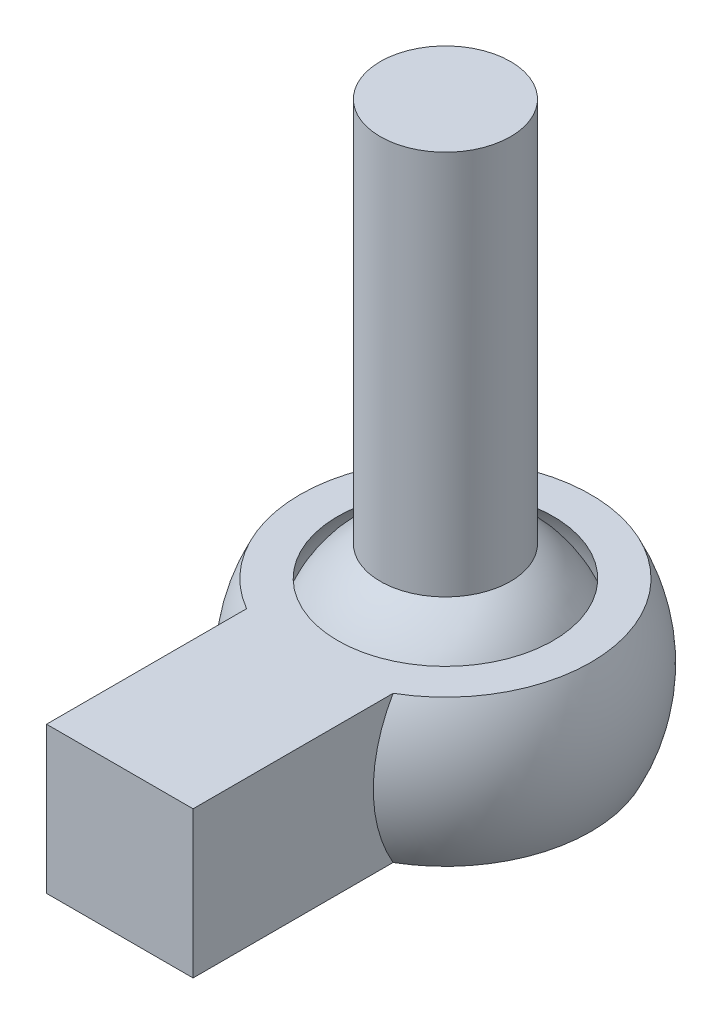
ISO-10303-21;
HEADER;
FILE_DESCRIPTION(('STEP AP214'),'2;1');
FILE_NAME('part.step','',(''),(''),'','','');
FILE_SCHEMA(('AUTOMOTIVE_DESIGN { 1 0 10303 214 1 1 1 1 }'));
ENDSEC;
DATA;
#1=APPLICATION_CONTEXT('core data for automotive mechanical design processes');
#2=APPLICATION_PROTOCOL_DEFINITION('international standard','automotive_design',2000,#1);
#3=PRODUCT_CONTEXT('',#1,'mechanical');
#4=PRODUCT('Part','Part','',(#3));
#5=PRODUCT_RELATED_PRODUCT_CATEGORY('part','',(#4));
#6=PRODUCT_DEFINITION_FORMATION('','',#4);
#7=PRODUCT_DEFINITION_CONTEXT('part definition',#1,'design');
#8=PRODUCT_DEFINITION('design','',#6,#7);
#9=PRODUCT_DEFINITION_SHAPE('','',#8);
#10=(LENGTH_UNIT() NAMED_UNIT(*) SI_UNIT(.MILLI.,.METRE.));
#11=(NAMED_UNIT(*) PLANE_ANGLE_UNIT() SI_UNIT($,.RADIAN.));
#12=(NAMED_UNIT(*) SI_UNIT($,.STERADIAN.) SOLID_ANGLE_UNIT());
#13=UNCERTAINTY_MEASURE_WITH_UNIT(LENGTH_MEASURE(1.E-05),#10,'distance_accuracy_value','');
#14=(GEOMETRIC_REPRESENTATION_CONTEXT(3) GLOBAL_UNCERTAINTY_ASSIGNED_CONTEXT((#13)) GLOBAL_UNIT_ASSIGNED_CONTEXT((#10,
#11,#12)) REPRESENTATION_CONTEXT('',''));
#15=CARTESIAN_POINT('',(0.,0.,0.));
#16=DIRECTION('',(0.,0.,1.));
#17=DIRECTION('',(1.,0.,0.));
#18=AXIS2_PLACEMENT_3D('',#15,#16,#17);
#19=CARTESIAN_POINT('',(0.,30.,0.));
#20=DIRECTION('',(0.,-1.,0.));
#21=DIRECTION('',(0.,0.,-1.));
#22=AXIS2_PLACEMENT_3D('',#19,#20,#21);
#23=CYLINDRICAL_SURFACE('',#22,4.);
#24=CARTESIAN_POINT('',(0.,6.34428877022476,0.));
#25=DIRECTION('',(0.,-1.,0.));
#26=DIRECTION('',(0.,0.,-1.));
#27=AXIS2_PLACEMENT_3D('',#24,#25,#26);
#28=CIRCLE('',#27,4.);
#29=CARTESIAN_POINT('',(0.,6.34428877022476,-4.));
#30=VERTEX_POINT('',#29);
#31=EDGE_CURVE('E11',#30,#30,#28,.T.);
#32=ORIENTED_EDGE('',*,*,#31,.F.);
#33=EDGE_LOOP('',(#32));
#34=FACE_BOUND('',#33,.T.);
#35=CARTESIAN_POINT('',(0.,30.,0.));
#36=DIRECTION('',(0.,1.,0.));
#37=DIRECTION('',(0.,0.,1.));
#38=AXIS2_PLACEMENT_3D('',#35,#36,#37);
#39=CIRCLE('',#38,4.);
#40=CARTESIAN_POINT('',(0.,30.,4.));
#41=VERTEX_POINT('',#40);
#42=EDGE_CURVE('E57',#41,#41,#39,.T.);
#43=ORIENTED_EDGE('',*,*,#42,.F.);
#44=EDGE_LOOP('',(#43));
#45=FACE_BOUND('',#44,.T.);
#46=ADVANCED_FACE('F50',(#34,#45),#23,.T.);
#47=CARTESIAN_POINT('',(0.,30.,0.));
#48=DIRECTION('',(0.,1.,0.));
#49=DIRECTION('',(0.,0.,1.));
#50=AXIS2_PLACEMENT_3D('',#47,#48,#49);
#51=PLANE('',#50);
#52=ORIENTED_EDGE('',*,*,#42,.T.);
#53=EDGE_LOOP('',(#52));
#54=FACE_BOUND('',#53,.T.);
#55=ADVANCED_FACE('F63',(#54),#51,.T.);
#56=CARTESIAN_POINT('',(0.,0.,0.));
#57=DIRECTION('',(0.,-1.,0.));
#58=DIRECTION('',(-1.,0.,0.));
#59=AXIS2_PLACEMENT_3D('',#56,#57,#58);
#60=SPHERICAL_SURFACE('',#59,7.5);
#61=ORIENTED_EDGE('',*,*,#31,.T.);
#62=EDGE_LOOP('',(#61));
#63=FACE_BOUND('',#62,.T.);
#64=ADVANCED_FACE('F52',(#63),#60,.T.);
#65=CLOSED_SHELL('',(#46,#55,#64));
#66=MANIFOLD_SOLID_BREP('B2',#65);
#67=CARTESIAN_POINT('',(0.,4.5,6.61437827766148));
#68=DIRECTION('',(0.,-1.,0.));
#69=DIRECTION('',(0.,0.,-1.));
#70=AXIS2_PLACEMENT_3D('',#67,#68,#69);
#71=PLANE('',#70);
#72=CARTESIAN_POINT('',(0.,4.5,0.));
#73=DIRECTION('',(0.,-1.,0.));
#74=DIRECTION('',(0.,0.,-1.));
#75=AXIS2_PLACEMENT_3D('',#72,#73,#74);
#76=CIRCLE('',#75,6.61437827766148);
#77=CARTESIAN_POINT('',(0.,4.5,6.61437827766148));
#78=VERTEX_POINT('',#77);
#79=EDGE_CURVE('E156',#78,#78,#76,.T.);
#80=ORIENTED_EDGE('',*,*,#79,.T.);
#81=EDGE_LOOP('',(#80));
#82=FACE_BOUND('',#81,.T.);
#83=DIRECTION('',(1.,0.,0.));
#84=VECTOR('',#83,1.);
#85=CARTESIAN_POINT('',(-10.,4.5,20.));
#86=LINE('',#85,#84);
#87=CARTESIAN_POINT('',(-4.5,4.5,20.));
#88=VERTEX_POINT('',#87);
#89=CARTESIAN_POINT('',(4.5,4.5,20.));
#90=VERTEX_POINT('',#89);
#91=EDGE_CURVE('E137',#88,#90,#86,.T.);
#92=ORIENTED_EDGE('',*,*,#91,.T.);
#93=DIRECTION('',(0.,0.,1.));
#94=VECTOR('',#93,1.);
#95=CARTESIAN_POINT('',(4.5,4.5,-10.002));
#96=LINE('',#95,#94);
#97=CARTESIAN_POINT('',(4.5,4.5,7.71362431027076));
#98=VERTEX_POINT('',#97);
#99=EDGE_CURVE('E147',#98,#90,#96,.T.);
#100=ORIENTED_EDGE('',*,*,#99,.F.);
#101=CARTESIAN_POINT('',(0.,4.5,0.));
#102=DIRECTION('',(0.,-1.,0.));
#103=DIRECTION('',(0.,0.,-1.));
#104=AXIS2_PLACEMENT_3D('',#101,#102,#103);
#105=CIRCLE('',#104,8.93028554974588);
#106=CARTESIAN_POINT('',(-4.5,4.5,7.71362431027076));
#107=VERTEX_POINT('',#106);
#108=EDGE_CURVE('E48',#107,#98,#105,.T.);
#109=ORIENTED_EDGE('',*,*,#108,.F.);
#110=DIRECTION('',(0.,0.,1.));
#111=VECTOR('',#110,1.);
#112=CARTESIAN_POINT('',(-4.5,4.5,-10.002));
#113=LINE('',#112,#111);
#114=EDGE_CURVE('E148',#107,#88,#113,.T.);
#115=ORIENTED_EDGE('',*,*,#114,.T.);
#116=EDGE_LOOP('',(#92,#100,#109,#115));
#117=FACE_BOUND('',#116,.T.);
#118=ADVANCED_FACE('F96',(#82,#117),#71,.F.);
#119=CARTESIAN_POINT('',(0.,-4.5,6.61437827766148));
#120=DIRECTION('',(0.,-1.,0.));
#121=DIRECTION('',(0.,0.,-1.));
#122=AXIS2_PLACEMENT_3D('',#119,#120,#121);
#123=PLANE('',#122);
#124=CARTESIAN_POINT('',(0.,-4.5,0.));
#125=DIRECTION('',(0.,-1.,0.));
#126=DIRECTION('',(0.,0.,-1.));
#127=AXIS2_PLACEMENT_3D('',#124,#125,#126);
#128=CIRCLE('',#127,6.61437827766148);
#129=CARTESIAN_POINT('',(0.,-4.5,6.61437827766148));
#130=VERTEX_POINT('',#129);
#131=EDGE_CURVE('E166',#130,#130,#128,.T.);
#132=ORIENTED_EDGE('',*,*,#131,.F.);
#133=EDGE_LOOP('',(#132));
#134=FACE_BOUND('',#133,.T.);
#135=DIRECTION('',(0.,0.,1.));
#136=VECTOR('',#135,1.);
#137=CARTESIAN_POINT('',(4.5,-4.5,-10.002));
#138=LINE('',#137,#136);
#139=CARTESIAN_POINT('',(4.5,-4.5,7.71362431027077));
#140=VERTEX_POINT('',#139);
#141=CARTESIAN_POINT('',(4.5,-4.5,20.));
#142=VERTEX_POINT('',#141);
#143=EDGE_CURVE('E154',#140,#142,#138,.T.);
#144=ORIENTED_EDGE('',*,*,#143,.T.);
#145=DIRECTION('',(1.,0.,0.));
#146=VECTOR('',#145,1.);
#147=CARTESIAN_POINT('',(-10.,-4.5,20.));
#148=LINE('',#147,#146);
#149=CARTESIAN_POINT('',(-4.5,-4.5,20.));
#150=VERTEX_POINT('',#149);
#151=EDGE_CURVE('E110',#150,#142,#148,.T.);
#152=ORIENTED_EDGE('',*,*,#151,.F.);
#153=DIRECTION('',(0.,0.,1.));
#154=VECTOR('',#153,1.);
#155=CARTESIAN_POINT('',(-4.5,-4.5,-10.002));
#156=LINE('',#155,#154);
#157=CARTESIAN_POINT('',(-4.5,-4.49999999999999,7.71362431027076));
#158=VERTEX_POINT('',#157);
#159=EDGE_CURVE('E117',#158,#150,#156,.T.);
#160=ORIENTED_EDGE('',*,*,#159,.F.);
#161=CARTESIAN_POINT('',(0.,-4.49999999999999,0.));
#162=DIRECTION('',(0.,-1.,0.));
#163=DIRECTION('',(0.,0.,-1.));
#164=AXIS2_PLACEMENT_3D('',#161,#162,#163);
#165=CIRCLE('',#164,8.93028554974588);
#166=EDGE_CURVE('E103',#158,#140,#165,.T.);
#167=ORIENTED_EDGE('',*,*,#166,.T.);
#168=EDGE_LOOP('',(#144,#152,#160,#167));
#169=FACE_BOUND('',#168,.T.);
#170=ADVANCED_FACE('F169',(#134,#169),#123,.T.);
#171=CARTESIAN_POINT('',(-4.5,-4.5,-10.002));
#172=DIRECTION('',(-1.,0.,0.));
#173=DIRECTION('',(0.,0.,1.));
#174=AXIS2_PLACEMENT_3D('',#171,#172,#173);
#175=PLANE('',#174);
#176=ORIENTED_EDGE('',*,*,#159,.T.);
#177=DIRECTION('',(0.,1.,0.));
#178=VECTOR('',#177,1.);
#179=CARTESIAN_POINT('',(-4.5,-4.5,20.));
#180=LINE('',#179,#178);
#181=EDGE_CURVE('E149',#150,#88,#180,.T.);
#182=ORIENTED_EDGE('',*,*,#181,.T.);
#183=ORIENTED_EDGE('',*,*,#114,.F.);
#184=CARTESIAN_POINT('',(-4.5,0.,0.));
#185=DIRECTION('',(-1.,0.,0.));
#186=DIRECTION('',(0.,0.,1.));
#187=AXIS2_PLACEMENT_3D('',#184,#185,#186);
#188=CIRCLE('',#187,8.93028554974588);
#189=EDGE_CURVE('E162',#107,#158,#188,.F.);
#190=ORIENTED_EDGE('',*,*,#189,.T.);
#191=EDGE_LOOP('',(#176,#182,#183,#190));
#192=FACE_BOUND('',#191,.T.);
#193=ADVANCED_FACE('F176',(#192),#175,.T.);
#194=CARTESIAN_POINT('',(4.5,-4.5,-10.002));
#195=DIRECTION('',(1.,0.,0.));
#196=DIRECTION('',(0.,0.,-1.));
#197=AXIS2_PLACEMENT_3D('',#194,#195,#196);
#198=PLANE('',#197);
#199=ORIENTED_EDGE('',*,*,#99,.T.);
#200=DIRECTION('',(0.,-1.,0.));
#201=VECTOR('',#200,1.);
#202=CARTESIAN_POINT('',(4.5,4.5,20.));
#203=LINE('',#202,#201);
#204=EDGE_CURVE('E134',#90,#142,#203,.T.);
#205=ORIENTED_EDGE('',*,*,#204,.T.);
#206=ORIENTED_EDGE('',*,*,#143,.F.);
#207=CARTESIAN_POINT('',(4.5,0.,0.));
#208=DIRECTION('',(1.,0.,0.));
#209=DIRECTION('',(0.,0.,-1.));
#210=AXIS2_PLACEMENT_3D('',#207,#208,#209);
#211=CIRCLE('',#210,8.93028554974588);
#212=EDGE_CURVE('E153',#140,#98,#211,.F.);
#213=ORIENTED_EDGE('',*,*,#212,.T.);
#214=EDGE_LOOP('',(#199,#205,#206,#213));
#215=FACE_BOUND('',#214,.T.);
#216=ADVANCED_FACE('F151',(#215),#198,.T.);
#217=CARTESIAN_POINT('',(0.,0.,0.));
#218=DIRECTION('',(0.,-1.,0.));
#219=DIRECTION('',(0.,0.,1.));
#220=AXIS2_PLACEMENT_3D('',#217,#218,#219);
#221=SPHERICAL_SURFACE('',#220,10.);
#222=ORIENTED_EDGE('',*,*,#166,.F.);
#223=ORIENTED_EDGE('',*,*,#189,.F.);
#224=ORIENTED_EDGE('',*,*,#108,.T.);
#225=ORIENTED_EDGE('',*,*,#212,.F.);
#226=EDGE_LOOP('',(#222,#223,#224,#225));
#227=FACE_BOUND('',#226,.T.);
#228=ADVANCED_FACE('F172',(#227),#221,.T.);
#229=CARTESIAN_POINT('',(0.,0.,0.));
#230=DIRECTION('',(0.,-1.,0.));
#231=DIRECTION('',(0.,0.,1.));
#232=AXIS2_PLACEMENT_3D('',#229,#230,#231);
#233=SPHERICAL_SURFACE('',#232,8.);
#234=CARTESIAN_POINT('',(0.,-4.5,6.61437827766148));
#235=CARTESIAN_POINT('',(0.,-4.41767816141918,6.67038591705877));
#236=CARTESIAN_POINT('',(0.,-4.3343097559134,6.72485514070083));
#237=CARTESIAN_POINT('',(0.,-4.16559819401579,6.83064429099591));
#238=CARTESIAN_POINT('',(0.,-4.08025503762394,6.88196421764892));
#239=CARTESIAN_POINT('',(0.,-3.90771235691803,6.98138230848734));
#240=CARTESIAN_POINT('',(0.,-3.82051283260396,7.02948047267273));
#241=CARTESIAN_POINT('',(0.,-3.64437912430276,7.12238824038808));
#242=CARTESIAN_POINT('',(0.,-3.55544494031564,7.16719784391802));
#243=CARTESIAN_POINT('',(0.,-3.3759658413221,7.25346596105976));
#244=CARTESIAN_POINT('',(0.,-3.28542092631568,7.29492447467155));
#245=CARTESIAN_POINT('',(0.,-3.10284659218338,7.37443263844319));
#246=CARTESIAN_POINT('',(0.,-3.01081717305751,7.41248228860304));
#247=CARTESIAN_POINT('',(0.,-2.82540211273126,7.48511968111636));
#248=CARTESIAN_POINT('',(0.,-2.73201647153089,7.51970742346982));
#249=CARTESIAN_POINT('',(0.,-2.54401914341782,7.58537278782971));
#250=CARTESIAN_POINT('',(0.,-2.44940745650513,7.61645040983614));
#251=CARTESIAN_POINT('',(0.,-2.25908992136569,7.67505221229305));
#252=CARTESIAN_POINT('',(0.,-2.16338407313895,7.70257639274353));
#253=CARTESIAN_POINT('',(0.,-1.97101162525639,7.75403294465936));
#254=CARTESIAN_POINT('',(0.,-1.87434502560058,7.77796531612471));
#255=CARTESIAN_POINT('',(0.,-1.68018582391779,7.82220488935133));
#256=CARTESIAN_POINT('',(0.,-1.58269322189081,7.84251209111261));
#257=CARTESIAN_POINT('',(0.,-1.3870179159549,7.87947301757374));
#258=CARTESIAN_POINT('',(0.,-1.28883521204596,7.89612674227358));
#259=CARTESIAN_POINT('',(0.,-1.09191656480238,7.92575750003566));
#260=CARTESIAN_POINT('',(0.,-0.993180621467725,7.93873453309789));
#261=CARTESIAN_POINT('',(0.,-0.795293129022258,7.96099381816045));
#262=CARTESIAN_POINT('',(0.,-0.696141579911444,7.97027607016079));
#263=CARTESIAN_POINT('',(0.,-0.497561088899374,7.98513285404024));
#264=CARTESIAN_POINT('',(0.,-0.398132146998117,7.99070738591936));
#265=CARTESIAN_POINT('',(0.,-0.199135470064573,7.99814095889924));
#266=CARTESIAN_POINT('',(0.,-0.0995677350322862,8.));
#267=CARTESIAN_POINT('',(0.,0.099567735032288,8.));
#268=CARTESIAN_POINT('',(0.,0.199135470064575,7.99814095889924));
#269=CARTESIAN_POINT('',(0.,0.398132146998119,7.99070738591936));
#270=CARTESIAN_POINT('',(0.,0.497561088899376,7.98513285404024));
#271=CARTESIAN_POINT('',(0.,0.696141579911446,7.97027607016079));
#272=CARTESIAN_POINT('',(0.,0.79529312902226,7.96099381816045));
#273=CARTESIAN_POINT('',(0.,0.993180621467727,7.93873453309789));
#274=CARTESIAN_POINT('',(0.,1.09191656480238,7.92575750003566));
#275=CARTESIAN_POINT('',(0.,1.28883521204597,7.89612674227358));
#276=CARTESIAN_POINT('',(0.,1.3870179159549,7.87947301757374));
#277=CARTESIAN_POINT('',(0.,1.58269322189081,7.84251209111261));
#278=CARTESIAN_POINT('',(0.,1.68018582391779,7.82220488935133));
#279=CARTESIAN_POINT('',(0.,1.87434502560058,7.77796531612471));
#280=CARTESIAN_POINT('',(0.,1.97101162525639,7.75403294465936));
#281=CARTESIAN_POINT('',(0.,2.16338407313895,7.70257639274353));
#282=CARTESIAN_POINT('',(0.,2.25908992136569,7.67505221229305));
#283=CARTESIAN_POINT('',(0.,2.44940745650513,7.61645040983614));
#284=CARTESIAN_POINT('',(0.,2.54401914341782,7.58537278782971));
#285=CARTESIAN_POINT('',(0.,2.73201647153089,7.51970742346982));
#286=CARTESIAN_POINT('',(0.,2.82540211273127,7.48511968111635));
#287=CARTESIAN_POINT('',(0.,3.01081717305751,7.41248228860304));
#288=CARTESIAN_POINT('',(0.,3.10284659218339,7.37443263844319));
#289=CARTESIAN_POINT('',(0.,3.28542092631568,7.29492447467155));
#290=CARTESIAN_POINT('',(0.,3.3759658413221,7.25346596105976));
#291=CARTESIAN_POINT('',(0.,3.55544494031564,7.16719784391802));
#292=CARTESIAN_POINT('',(0.,3.64437912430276,7.12238824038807));
#293=CARTESIAN_POINT('',(0.,3.82051283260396,7.02948047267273));
#294=CARTESIAN_POINT('',(0.,3.90771235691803,6.98138230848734));
#295=CARTESIAN_POINT('',(0.,4.08025503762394,6.88196421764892));
#296=CARTESIAN_POINT('',(0.,4.16559819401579,6.83064429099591));
#297=CARTESIAN_POINT('',(0.,4.3343097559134,6.72485514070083));
#298=CARTESIAN_POINT('',(0.,4.41767816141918,6.67038591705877));
#299=CARTESIAN_POINT('',(0.,4.5,6.61437827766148));
#300=B_SPLINE_CURVE_WITH_KNOTS('',3,(#234,#235,#236,#237,#238,#239,#240,#241,#242,#243,#244,
#245,#246,#247,#248,#249,#250,#251,#252,#253,#254,#255,#256,#257,#258,#259,#260,#261,#262,#263,
#264,#265,#266,#267,#268,#269,#270,#271,#272,#273,#274,#275,#276,#277,#278,#279,#280,#281,#282,
#283,#284,#285,#286,#287,#288,#289,#290,#291,#292,#293,#294,#295,#296,#297,#298,#299),
.UNSPECIFIED.,.F.,.F.,(4,2,2,2,2,2,2,2,2,2,2,2,2,2,2,2,2,2,2,2,2,2,2,2,2,2,2,2,2,2,2,2,4),(0.,
0.298685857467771,0.597371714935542,0.896057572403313,1.19474342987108,1.49342928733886,
1.79211514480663,2.0908010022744,2.38948685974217,2.68817271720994,2.98685857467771,
3.28554443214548,3.58423028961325,3.88291614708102,4.1816020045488,4.48028786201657,
4.77897371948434,5.07765957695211,5.37634543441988,5.67503129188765,5.97371714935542,
6.27240300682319,6.57108886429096,6.86977472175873,7.16846057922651,7.46714643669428,
7.76583229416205,8.06451815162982,8.36320400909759,8.66188986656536,8.96057572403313,
9.2592615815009,9.55794743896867),.UNSPECIFIED.);
#301=EDGE_CURVE('BSEAM194',#130,#78,#300,.T.);
#302=ORIENTED_EDGE('',*,*,#131,.T.);
#303=ORIENTED_EDGE('',*,*,#79,.F.);
#304=ORIENTED_EDGE('',*,*,#301,.T.);
#305=ORIENTED_EDGE('',*,*,#301,.F.);
#306=EDGE_LOOP('',(#302,#304,#303,#305));
#307=FACE_BOUND('',#306,.T.);
#308=ADVANCED_FACE('F194',(#307),#233,.F.);
#309=CARTESIAN_POINT('',(-10.,4.5,20.));
#310=DIRECTION('',(0.,0.,1.));
#311=DIRECTION('',(1.,0.,0.));
#312=AXIS2_PLACEMENT_3D('',#309,#310,#311);
#313=PLANE('',#312);
#314=ORIENTED_EDGE('',*,*,#151,.T.);
#315=ORIENTED_EDGE('',*,*,#204,.F.);
#316=ORIENTED_EDGE('',*,*,#91,.F.);
#317=ORIENTED_EDGE('',*,*,#181,.F.);
#318=EDGE_LOOP('',(#314,#315,#316,#317));
#319=FACE_BOUND('',#318,.T.);
#320=ADVANCED_FACE('F136',(#319),#313,.T.);
#321=CLOSED_SHELL('',(#118,#170,#193,#216,#228,#308,#320));
#322=MANIFOLD_SOLID_BREP('B6',#321);
#323=ADVANCED_BREP_SHAPE_REPRESENTATION('',(#18,#66,#322),#14);
#324=SHAPE_DEFINITION_REPRESENTATION(#9,#323);
ENDSEC;
END-ISO-10303-21;
